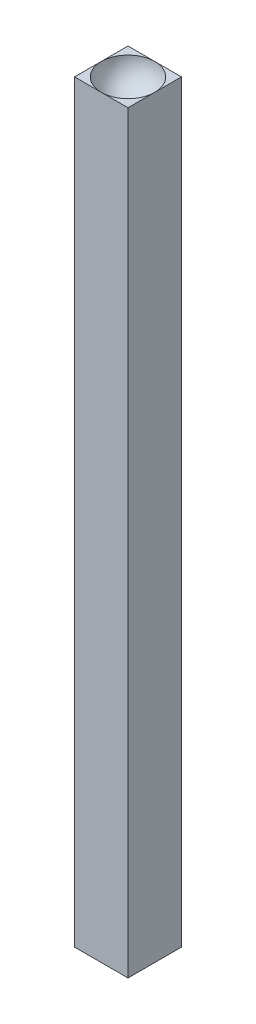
ISO-10303-21;
HEADER;
FILE_DESCRIPTION(('STEP AP214'),'2;1');
FILE_NAME('part.step','',(''),(''),'','','');
FILE_SCHEMA(('AUTOMOTIVE_DESIGN { 1 0 10303 214 1 1 1 1 }'));
ENDSEC;
DATA;
#1=APPLICATION_CONTEXT('core data for automotive mechanical design processes');
#2=APPLICATION_PROTOCOL_DEFINITION('international standard','automotive_design',2000,#1);
#3=PRODUCT_CONTEXT('',#1,'mechanical');
#4=PRODUCT('Part','Part','',(#3));
#5=PRODUCT_RELATED_PRODUCT_CATEGORY('part','',(#4));
#6=PRODUCT_DEFINITION_FORMATION('','',#4);
#7=PRODUCT_DEFINITION_CONTEXT('part definition',#1,'design');
#8=PRODUCT_DEFINITION('design','',#6,#7);
#9=PRODUCT_DEFINITION_SHAPE('','',#8);
#10=(LENGTH_UNIT() NAMED_UNIT(*) SI_UNIT(.MILLI.,.METRE.));
#11=(NAMED_UNIT(*) PLANE_ANGLE_UNIT() SI_UNIT($,.RADIAN.));
#12=(NAMED_UNIT(*) SI_UNIT($,.STERADIAN.) SOLID_ANGLE_UNIT());
#13=UNCERTAINTY_MEASURE_WITH_UNIT(LENGTH_MEASURE(1.E-05),#10,'distance_accuracy_value','');
#14=(GEOMETRIC_REPRESENTATION_CONTEXT(3) GLOBAL_UNCERTAINTY_ASSIGNED_CONTEXT((#13)) GLOBAL_UNIT_ASSIGNED_CONTEXT((#10,
#11,#12)) REPRESENTATION_CONTEXT('',''));
#15=CARTESIAN_POINT('',(0.,0.,0.));
#16=DIRECTION('',(0.,0.,1.));
#17=DIRECTION('',(1.,0.,0.));
#18=AXIS2_PLACEMENT_3D('',#15,#16,#17);
#19=CARTESIAN_POINT('',(0.,141.,0.));
#20=DIRECTION('',(0.,-1.,0.));
#21=DIRECTION('',(0.,0.,-1.));
#22=AXIS2_PLACEMENT_3D('',#19,#20,#21);
#23=PLANE('',#22);
#24=CARTESIAN_POINT('',(5.,141.,-5.));
#25=DIRECTION('',(0.,-1.,0.));
#26=DIRECTION('',(0.,0.,-1.));
#27=AXIS2_PLACEMENT_3D('',#24,#25,#26);
#28=CIRCLE('',#27,5.);
#29=CARTESIAN_POINT('',(5.,141.,-10.));
#30=VERTEX_POINT('',#29);
#31=CARTESIAN_POINT('',(0.,141.,-5.));
#32=VERTEX_POINT('',#31);
#33=EDGE_CURVE('E11',#30,#32,#28,.F.);
#34=ORIENTED_EDGE('',*,*,#33,.F.);
#35=DIRECTION('',(-1.,0.,0.));
#36=VECTOR('',#35,1.);
#37=CARTESIAN_POINT('',(0.,141.,-10.));
#38=LINE('',#37,#36);
#39=CARTESIAN_POINT('',(0.,141.,-10.));
#40=VERTEX_POINT('',#39);
#41=EDGE_CURVE('E60',#30,#40,#38,.T.);
#42=ORIENTED_EDGE('',*,*,#41,.T.);
#43=DIRECTION('',(0.,0.,1.));
#44=VECTOR('',#43,1.);
#45=CARTESIAN_POINT('',(0.,141.,0.));
#46=LINE('',#45,#44);
#47=EDGE_CURVE('E116',#40,#32,#46,.T.);
#48=ORIENTED_EDGE('',*,*,#47,.T.);
#49=EDGE_LOOP('',(#34,#42,#48));
#50=FACE_BOUND('',#49,.T.);
#51=ADVANCED_FACE('F35',(#50),#23,.F.);
#52=CARTESIAN_POINT('',(5.,141.,0.));
#53=VERTEX_POINT('',#52);
#54=EDGE_CURVE('E44',#32,#53,#28,.F.);
#55=ORIENTED_EDGE('',*,*,#54,.F.);
#56=CARTESIAN_POINT('',(0.,141.,0.));
#57=VERTEX_POINT('',#56);
#58=EDGE_CURVE('E90',#32,#57,#46,.T.);
#59=ORIENTED_EDGE('',*,*,#58,.T.);
#60=DIRECTION('',(1.,0.,0.));
#61=VECTOR('',#60,1.);
#62=CARTESIAN_POINT('',(0.,141.,0.));
#63=LINE('',#62,#61);
#64=EDGE_CURVE('E112',#57,#53,#63,.T.);
#65=ORIENTED_EDGE('',*,*,#64,.T.);
#66=EDGE_LOOP('',(#55,#59,#65));
#67=FACE_BOUND('',#66,.T.);
#68=ADVANCED_FACE('F118',(#67),#23,.F.);
#69=CARTESIAN_POINT('',(5.,141.,-5.));
#70=DIRECTION('',(0.,1.,0.));
#71=DIRECTION('',(0.,0.,1.));
#72=AXIS2_PLACEMENT_3D('',#69,#70,#71);
#73=CIRCLE('',#72,5.);
#74=CARTESIAN_POINT('',(10.,141.,-5.));
#75=VERTEX_POINT('',#74);
#76=EDGE_CURVE('E51',#53,#75,#73,.T.);
#77=ORIENTED_EDGE('',*,*,#76,.F.);
#78=CARTESIAN_POINT('',(10.,141.,0.));
#79=VERTEX_POINT('',#78);
#80=EDGE_CURVE('E103',#53,#79,#63,.T.);
#81=ORIENTED_EDGE('',*,*,#80,.T.);
#82=DIRECTION('',(0.,0.,-1.));
#83=VECTOR('',#82,1.);
#84=CARTESIAN_POINT('',(10.,141.,0.));
#85=LINE('',#84,#83);
#86=EDGE_CURVE('E106',#79,#75,#85,.T.);
#87=ORIENTED_EDGE('',*,*,#86,.T.);
#88=EDGE_LOOP('',(#77,#81,#87));
#89=FACE_BOUND('',#88,.T.);
#90=ADVANCED_FACE('F102',(#89),#23,.F.);
#91=CARTESIAN_POINT('',(0.,141.,0.));
#92=DIRECTION('',(1.,0.,0.));
#93=DIRECTION('',(0.,0.,-1.));
#94=AXIS2_PLACEMENT_3D('',#91,#92,#93);
#95=PLANE('',#94);
#96=DIRECTION('',(0.,0.,1.));
#97=VECTOR('',#96,1.);
#98=CARTESIAN_POINT('',(0.,0.,0.));
#99=LINE('',#98,#97);
#100=CARTESIAN_POINT('',(0.,0.,-10.));
#101=VERTEX_POINT('',#100);
#102=CARTESIAN_POINT('',(0.,0.,0.));
#103=VERTEX_POINT('',#102);
#104=EDGE_CURVE('E107',#101,#103,#99,.T.);
#105=ORIENTED_EDGE('',*,*,#104,.T.);
#106=DIRECTION('',(0.,-1.,0.));
#107=VECTOR('',#106,1.);
#108=CARTESIAN_POINT('',(0.,141.,0.));
#109=LINE('',#108,#107);
#110=EDGE_CURVE('E137',#57,#103,#109,.T.);
#111=ORIENTED_EDGE('',*,*,#110,.F.);
#112=ORIENTED_EDGE('',*,*,#58,.F.);
#113=ORIENTED_EDGE('',*,*,#47,.F.);
#114=DIRECTION('',(0.,-1.,0.));
#115=VECTOR('',#114,1.);
#116=CARTESIAN_POINT('',(0.,141.,-10.));
#117=LINE('',#116,#115);
#118=EDGE_CURVE('E126',#40,#101,#117,.T.);
#119=ORIENTED_EDGE('',*,*,#118,.T.);
#120=EDGE_LOOP('',(#105,#111,#112,#113,#119));
#121=FACE_BOUND('',#120,.T.);
#122=ADVANCED_FACE('F37',(#121),#95,.F.);
#123=CARTESIAN_POINT('',(0.,141.,0.));
#124=DIRECTION('',(0.,0.,-1.));
#125=DIRECTION('',(-1.,0.,0.));
#126=AXIS2_PLACEMENT_3D('',#123,#124,#125);
#127=PLANE('',#126);
#128=DIRECTION('',(1.,0.,0.));
#129=VECTOR('',#128,1.);
#130=CARTESIAN_POINT('',(0.,0.,0.));
#131=LINE('',#130,#129);
#132=CARTESIAN_POINT('',(10.,0.,0.));
#133=VERTEX_POINT('',#132);
#134=EDGE_CURVE('E129',#103,#133,#131,.T.);
#135=ORIENTED_EDGE('',*,*,#134,.T.);
#136=DIRECTION('',(0.,-1.,0.));
#137=VECTOR('',#136,1.);
#138=CARTESIAN_POINT('',(10.,141.,0.));
#139=LINE('',#138,#137);
#140=EDGE_CURVE('E115',#79,#133,#139,.T.);
#141=ORIENTED_EDGE('',*,*,#140,.F.);
#142=ORIENTED_EDGE('',*,*,#80,.F.);
#143=ORIENTED_EDGE('',*,*,#64,.F.);
#144=ORIENTED_EDGE('',*,*,#110,.T.);
#145=EDGE_LOOP('',(#135,#141,#142,#143,#144));
#146=FACE_BOUND('',#145,.T.);
#147=ADVANCED_FACE('F110',(#146),#127,.F.);
#148=CARTESIAN_POINT('',(10.,141.,0.));
#149=DIRECTION('',(-1.,0.,0.));
#150=DIRECTION('',(0.,0.,1.));
#151=AXIS2_PLACEMENT_3D('',#148,#149,#150);
#152=PLANE('',#151);
#153=DIRECTION('',(0.,0.,-1.));
#154=VECTOR('',#153,1.);
#155=CARTESIAN_POINT('',(10.,0.,0.));
#156=LINE('',#155,#154);
#157=CARTESIAN_POINT('',(10.,0.,-10.));
#158=VERTEX_POINT('',#157);
#159=EDGE_CURVE('E131',#133,#158,#156,.T.);
#160=ORIENTED_EDGE('',*,*,#159,.T.);
#161=DIRECTION('',(0.,-1.,0.));
#162=VECTOR('',#161,1.);
#163=CARTESIAN_POINT('',(10.,141.,-10.));
#164=LINE('',#163,#162);
#165=CARTESIAN_POINT('',(10.,141.,-10.));
#166=VERTEX_POINT('',#165);
#167=EDGE_CURVE('E135',#166,#158,#164,.T.);
#168=ORIENTED_EDGE('',*,*,#167,.F.);
#169=EDGE_CURVE('E119',#75,#166,#85,.T.);
#170=ORIENTED_EDGE('',*,*,#169,.F.);
#171=ORIENTED_EDGE('',*,*,#86,.F.);
#172=ORIENTED_EDGE('',*,*,#140,.T.);
#173=EDGE_LOOP('',(#160,#168,#170,#171,#172));
#174=FACE_BOUND('',#173,.T.);
#175=ADVANCED_FACE('F146',(#174),#152,.F.);
#176=CARTESIAN_POINT('',(0.,141.,-10.));
#177=DIRECTION('',(0.,0.,1.));
#178=DIRECTION('',(1.,0.,0.));
#179=AXIS2_PLACEMENT_3D('',#176,#177,#178);
#180=PLANE('',#179);
#181=DIRECTION('',(-1.,0.,0.));
#182=VECTOR('',#181,1.);
#183=CARTESIAN_POINT('',(0.,0.,-10.));
#184=LINE('',#183,#182);
#185=EDGE_CURVE('E82',#158,#101,#184,.T.);
#186=ORIENTED_EDGE('',*,*,#185,.T.);
#187=ORIENTED_EDGE('',*,*,#118,.F.);
#188=ORIENTED_EDGE('',*,*,#41,.F.);
#189=EDGE_CURVE('E123',#166,#30,#38,.T.);
#190=ORIENTED_EDGE('',*,*,#189,.F.);
#191=ORIENTED_EDGE('',*,*,#167,.T.);
#192=EDGE_LOOP('',(#186,#187,#188,#190,#191));
#193=FACE_BOUND('',#192,.T.);
#194=ADVANCED_FACE('F142',(#193),#180,.F.);
#195=EDGE_CURVE('E39',#75,#30,#28,.F.);
#196=ORIENTED_EDGE('',*,*,#195,.F.);
#197=ORIENTED_EDGE('',*,*,#169,.T.);
#198=ORIENTED_EDGE('',*,*,#189,.T.);
#199=EDGE_LOOP('',(#196,#197,#198));
#200=FACE_BOUND('',#199,.T.);
#201=ADVANCED_FACE('F143',(#200),#23,.F.);
#202=CARTESIAN_POINT('',(0.,0.,0.));
#203=DIRECTION('',(0.,-1.,0.));
#204=DIRECTION('',(0.,0.,-1.));
#205=AXIS2_PLACEMENT_3D('',#202,#203,#204);
#206=PLANE('',#205);
#207=ORIENTED_EDGE('',*,*,#104,.F.);
#208=ORIENTED_EDGE('',*,*,#185,.F.);
#209=ORIENTED_EDGE('',*,*,#159,.F.);
#210=ORIENTED_EDGE('',*,*,#134,.F.);
#211=EDGE_LOOP('',(#207,#208,#209,#210));
#212=FACE_BOUND('',#211,.T.);
#213=ADVANCED_FACE('F150',(#212),#206,.T.);
#214=CARTESIAN_POINT('',(5.,141.,-5.));
#215=DIRECTION('',(0.,1.,0.));
#216=DIRECTION('',(1.,0.,0.));
#217=AXIS2_PLACEMENT_3D('',#214,#215,#216);
#218=SPHERICAL_SURFACE('',#217,5.);
#219=ORIENTED_EDGE('',*,*,#76,.T.);
#220=ORIENTED_EDGE('',*,*,#195,.T.);
#221=ORIENTED_EDGE('',*,*,#33,.T.);
#222=ORIENTED_EDGE('',*,*,#54,.T.);
#223=EDGE_LOOP('',(#219,#220,#221,#222));
#224=FACE_BOUND('',#223,.T.);
#225=ADVANCED_FACE('F98',(#224),#218,.F.);
#226=CLOSED_SHELL('',(#51,#68,#90,#122,#147,#175,#194,#201,#213,#225));
#227=MANIFOLD_SOLID_BREP('B2',#226);
#228=ADVANCED_BREP_SHAPE_REPRESENTATION('',(#18,#227),#14);
#229=SHAPE_DEFINITION_REPRESENTATION(#9,#228);
ENDSEC;
END-ISO-10303-21;
